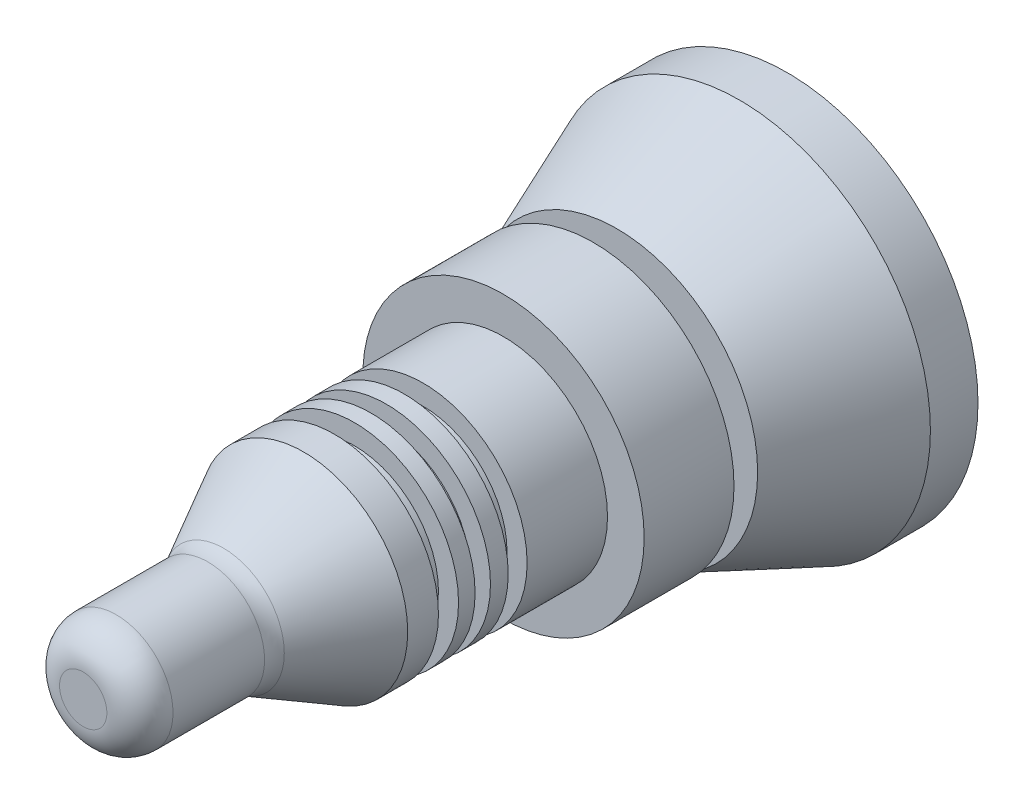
from build123d import *


with BuildPart() as part:
    # Sketch2 → Base-Revolve (revolve)
    with BuildSketch(Plane(origin=(0, 0, 0), x_dir=(0, 0, -1), z_dir=(1, 0, 0)), mode=Mode.PRIVATE) as base_revolve_sk:
        with BuildLine():
            Line((0, 0), (0, 7.157615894))
            ThreePointArc((0, 7.157615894), (2.928932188, 14.228683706), (10, 17.157615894))
            Line((10, 17.157615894), (37.683421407, 17.157615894))
            ThreePointArc((37.683421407, 17.157615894), (40.135904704, 17.463012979), (42.43859175, 18.360550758))
            Line((42.43859175, 18.360550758), (66.664486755, 31.455629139))
            Line((66.664486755, 31.455629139), (75.958195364, 31.455629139))
            Line((75.958195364, 31.455629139), (75.958195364, 25.37897351))
            Line((75.958195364, 25.37897351), (82.034850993, 25.37897351))
            Line((82.034850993, 25.37897351), (82.034850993, 31.455629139))
            Line((82.034850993, 31.455629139), (87.039155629, 31.455629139))
            Line((87.039155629, 31.455629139), (87.039155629, 25.37897351))
            Line((87.039155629, 25.37897351), (91.686009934, 25.37897351))
            Line((91.686009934, 25.37897351), (91.686009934, 31.455629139))
            Line((91.686009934, 31.455629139), (97.047764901, 31.455629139))
            Line((97.047764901, 31.455629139), (97.047764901, 25.37897351))
            Line((97.047764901, 25.37897351), (102.766970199, 25.37897351))
            Line((102.766970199, 25.37897351), (102.766970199, 31.455629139))
            Line((102.766970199, 31.455629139), (127.073592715, 31.455629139))
            Line((127.073592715, 31.455629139), (127.073592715, 42.536589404))
            Line((127.073592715, 42.536589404), (154.239817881, 42.536589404))
            Line((154.239817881, 42.536589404), (154.239817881, 22.876821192))
            Line((154.239817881, 22.876821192), (161.388824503, 22.876821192))
            Line((161.388824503, 22.876821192), (161.388824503, 42.536589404))
            Line((161.388824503, 42.536589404), (198.44705448, 57.712816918))
            Line((198.44705448, 57.712816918), (212.836397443, 57.712816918))
            Line((212.836397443, 57.712816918), (212.836397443, 0))
            Line((212.836397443, 0), (0, 0))
        make_face()
    revolve(base_revolve_sk.sketch.rotate(Axis((0, 0, 62.732533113), (0, 0, -1)), 90), axis=Axis((0, 0, 62.732533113), (0, 0, -1)))


solid = part.part
